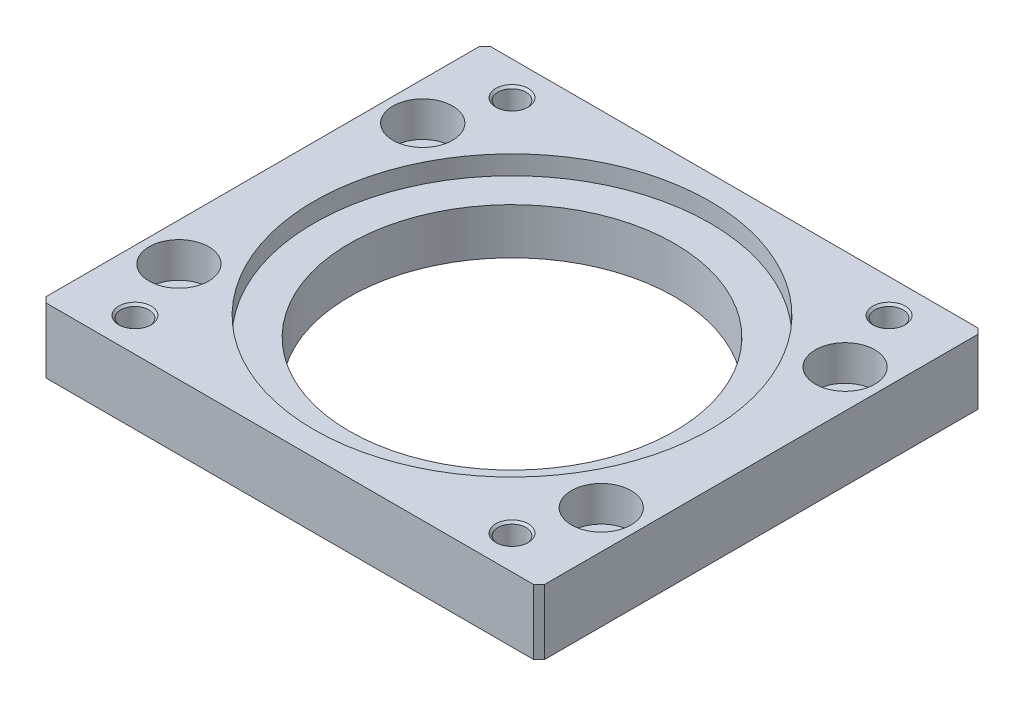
ISO-10303-21;
HEADER;
FILE_DESCRIPTION(('STEP AP214'),'2;1');
FILE_NAME('part.step','',(''),(''),'','','');
FILE_SCHEMA(('AUTOMOTIVE_DESIGN { 1 0 10303 214 1 1 1 1 }'));
ENDSEC;
DATA;
#1=APPLICATION_CONTEXT('core data for automotive mechanical design processes');
#2=APPLICATION_PROTOCOL_DEFINITION('international standard','automotive_design',2000,#1);
#3=PRODUCT_CONTEXT('',#1,'mechanical');
#4=PRODUCT('Part','Part','',(#3));
#5=PRODUCT_RELATED_PRODUCT_CATEGORY('part','',(#4));
#6=PRODUCT_DEFINITION_FORMATION('','',#4);
#7=PRODUCT_DEFINITION_CONTEXT('part definition',#1,'design');
#8=PRODUCT_DEFINITION('design','',#6,#7);
#9=PRODUCT_DEFINITION_SHAPE('','',#8);
#10=(LENGTH_UNIT() NAMED_UNIT(*) SI_UNIT(.MILLI.,.METRE.));
#11=(NAMED_UNIT(*) PLANE_ANGLE_UNIT() SI_UNIT($,.RADIAN.));
#12=(NAMED_UNIT(*) SI_UNIT($,.STERADIAN.) SOLID_ANGLE_UNIT());
#13=UNCERTAINTY_MEASURE_WITH_UNIT(LENGTH_MEASURE(1.E-05),#10,'distance_accuracy_value','');
#14=(GEOMETRIC_REPRESENTATION_CONTEXT(3) GLOBAL_UNCERTAINTY_ASSIGNED_CONTEXT((#13)) GLOBAL_UNIT_ASSIGNED_CONTEXT((#10,
#11,#12)) REPRESENTATION_CONTEXT('',''));
#15=CARTESIAN_POINT('',(0.,0.,0.));
#16=DIRECTION('',(0.,0.,1.));
#17=DIRECTION('',(1.,0.,0.));
#18=AXIS2_PLACEMENT_3D('',#15,#16,#17);
#19=CARTESIAN_POINT('',(-34.79,11.6,34.79));
#20=DIRECTION('',(0.,1.,0.));
#21=DIRECTION('',(-1.,0.,0.));
#22=AXIS2_PLACEMENT_3D('',#19,#20,#21);
#23=CONICAL_SURFACE('',#22,2.6,0.785398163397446);
#24=CARTESIAN_POINT('',(-34.79,11.6,34.79));
#25=DIRECTION('',(0.,1.,0.));
#26=DIRECTION('',(1.,0.,0.));
#27=AXIS2_PLACEMENT_3D('',#24,#25,#26);
#28=CIRCLE('',#27,2.6);
#29=CARTESIAN_POINT('',(-32.19,11.6,34.79));
#30=VERTEX_POINT('',#29);
#31=EDGE_CURVE('E169',#30,#30,#28,.F.);
#32=ORIENTED_EDGE('',*,*,#31,.T.);
#33=EDGE_LOOP('',(#32));
#34=FACE_BOUND('',#33,.T.);
#35=CARTESIAN_POINT('',(-34.79,12.,34.79));
#36=DIRECTION('',(0.,1.,0.));
#37=DIRECTION('',(0.,0.,1.));
#38=AXIS2_PLACEMENT_3D('',#35,#36,#37);
#39=CIRCLE('',#38,3.);
#40=CARTESIAN_POINT('',(-34.79,12.,37.79));
#41=VERTEX_POINT('',#40);
#42=EDGE_CURVE('E188',#41,#41,#39,.T.);
#43=ORIENTED_EDGE('',*,*,#42,.T.);
#44=EDGE_LOOP('',(#43));
#45=FACE_BOUND('',#44,.T.);
#46=ADVANCED_FACE('F16',(#34,#45),#23,.F.);
#47=CARTESIAN_POINT('',(34.79,11.6,34.79));
#48=DIRECTION('',(0.,1.,0.));
#49=DIRECTION('',(0.,0.,1.));
#50=AXIS2_PLACEMENT_3D('',#47,#48,#49);
#51=CONICAL_SURFACE('',#50,2.6,0.785398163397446);
#52=CARTESIAN_POINT('',(34.79,11.6,34.79));
#53=DIRECTION('',(0.,1.,0.));
#54=DIRECTION('',(1.,0.,0.));
#55=AXIS2_PLACEMENT_3D('',#52,#53,#54);
#56=CIRCLE('',#55,2.6);
#57=CARTESIAN_POINT('',(37.39,11.6,34.79));
#58=VERTEX_POINT('',#57);
#59=EDGE_CURVE('E241',#58,#58,#56,.F.);
#60=ORIENTED_EDGE('',*,*,#59,.T.);
#61=EDGE_LOOP('',(#60));
#62=FACE_BOUND('',#61,.T.);
#63=CARTESIAN_POINT('',(34.79,12.,34.79));
#64=DIRECTION('',(0.,1.,0.));
#65=DIRECTION('',(-1.,0.,0.));
#66=AXIS2_PLACEMENT_3D('',#63,#64,#65);
#67=CIRCLE('',#66,2.99999999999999);
#68=CARTESIAN_POINT('',(31.79,12.,34.79));
#69=VERTEX_POINT('',#68);
#70=EDGE_CURVE('E185',#69,#69,#67,.T.);
#71=ORIENTED_EDGE('',*,*,#70,.T.);
#72=EDGE_LOOP('',(#71));
#73=FACE_BOUND('',#72,.T.);
#74=ADVANCED_FACE('F342',(#62,#73),#51,.F.);
#75=CARTESIAN_POINT('',(34.79,11.6,-34.79));
#76=DIRECTION('',(0.,1.,0.));
#77=DIRECTION('',(0.,0.,1.));
#78=AXIS2_PLACEMENT_3D('',#75,#76,#77);
#79=CONICAL_SURFACE('',#78,2.6,0.785398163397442);
#80=CARTESIAN_POINT('',(34.79,11.6,-34.79));
#81=DIRECTION('',(0.,1.,0.));
#82=DIRECTION('',(1.,0.,0.));
#83=AXIS2_PLACEMENT_3D('',#80,#81,#82);
#84=CIRCLE('',#83,2.6);
#85=CARTESIAN_POINT('',(37.39,11.6,-34.79));
#86=VERTEX_POINT('',#85);
#87=EDGE_CURVE('E238',#86,#86,#84,.F.);
#88=ORIENTED_EDGE('',*,*,#87,.T.);
#89=EDGE_LOOP('',(#88));
#90=FACE_BOUND('',#89,.T.);
#91=CARTESIAN_POINT('',(34.79,12.,-34.79));
#92=DIRECTION('',(0.,1.,0.));
#93=DIRECTION('',(0.,0.,1.));
#94=AXIS2_PLACEMENT_3D('',#91,#92,#93);
#95=CIRCLE('',#94,3.);
#96=CARTESIAN_POINT('',(34.79,12.,-31.79));
#97=VERTEX_POINT('',#96);
#98=EDGE_CURVE('E191',#97,#97,#95,.T.);
#99=ORIENTED_EDGE('',*,*,#98,.T.);
#100=EDGE_LOOP('',(#99));
#101=FACE_BOUND('',#100,.T.);
#102=ADVANCED_FACE('F346',(#90,#101),#79,.F.);
#103=CARTESIAN_POINT('',(-34.79,11.6,-34.79));
#104=DIRECTION('',(0.,1.,0.));
#105=DIRECTION('',(0.,0.,1.));
#106=AXIS2_PLACEMENT_3D('',#103,#104,#105);
#107=CONICAL_SURFACE('',#106,2.6,0.78539816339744);
#108=CARTESIAN_POINT('',(-34.79,11.6,-34.79));
#109=DIRECTION('',(0.,1.,0.));
#110=DIRECTION('',(1.,0.,0.));
#111=AXIS2_PLACEMENT_3D('',#108,#109,#110);
#112=CIRCLE('',#111,2.6);
#113=CARTESIAN_POINT('',(-32.19,11.6,-34.79));
#114=VERTEX_POINT('',#113);
#115=EDGE_CURVE('E165',#114,#114,#112,.F.);
#116=ORIENTED_EDGE('',*,*,#115,.T.);
#117=EDGE_LOOP('',(#116));
#118=FACE_BOUND('',#117,.T.);
#119=CARTESIAN_POINT('',(-34.79,12.,-34.79));
#120=DIRECTION('',(0.,1.,0.));
#121=DIRECTION('',(0.,0.,1.));
#122=AXIS2_PLACEMENT_3D('',#119,#120,#121);
#123=CIRCLE('',#122,3.);
#124=CARTESIAN_POINT('',(-34.79,12.,-31.79));
#125=VERTEX_POINT('',#124);
#126=EDGE_CURVE('E170',#125,#125,#123,.T.);
#127=ORIENTED_EDGE('',*,*,#126,.T.);
#128=EDGE_LOOP('',(#127));
#129=FACE_BOUND('',#128,.T.);
#130=ADVANCED_FACE('F350',(#118,#129),#107,.F.);
#131=CARTESIAN_POINT('',(38.9711431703,5.5,-22.5));
#132=DIRECTION('',(0.,1.,0.));
#133=DIRECTION('',(0.,0.,1.));
#134=AXIS2_PLACEMENT_3D('',#131,#132,#133);
#135=CYLINDRICAL_SURFACE('',#134,5.49999999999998);
#136=CARTESIAN_POINT('',(38.9711431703,5.5,-22.5));
#137=DIRECTION('',(0.,1.,0.));
#138=DIRECTION('',(0.,0.,1.));
#139=AXIS2_PLACEMENT_3D('',#136,#137,#138);
#140=CIRCLE('',#139,5.49999999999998);
#141=CARTESIAN_POINT('',(38.9711431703,5.5,-17.));
#142=VERTEX_POINT('',#141);
#143=EDGE_CURVE('E162',#142,#142,#140,.F.);
#144=ORIENTED_EDGE('',*,*,#143,.T.);
#145=EDGE_LOOP('',(#144));
#146=FACE_BOUND('',#145,.T.);
#147=CARTESIAN_POINT('',(38.9711431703,12.,-22.5));
#148=DIRECTION('',(0.,1.,0.));
#149=DIRECTION('',(0.,0.,1.));
#150=AXIS2_PLACEMENT_3D('',#147,#148,#149);
#151=CIRCLE('',#150,5.49999999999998);
#152=CARTESIAN_POINT('',(38.9711431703,12.,-17.));
#153=VERTEX_POINT('',#152);
#154=EDGE_CURVE('E182',#153,#153,#151,.T.);
#155=ORIENTED_EDGE('',*,*,#154,.T.);
#156=EDGE_LOOP('',(#155));
#157=FACE_BOUND('',#156,.T.);
#158=ADVANCED_FACE('F354',(#146,#157),#135,.F.);
#159=CARTESIAN_POINT('',(38.9711431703,5.5,22.5));
#160=DIRECTION('',(0.,1.,0.));
#161=DIRECTION('',(0.,0.,1.));
#162=AXIS2_PLACEMENT_3D('',#159,#160,#161);
#163=CYLINDRICAL_SURFACE('',#162,5.49999999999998);
#164=CARTESIAN_POINT('',(38.9711431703,5.5,22.5));
#165=DIRECTION('',(0.,1.,0.));
#166=DIRECTION('',(0.,0.,1.));
#167=AXIS2_PLACEMENT_3D('',#164,#165,#166);
#168=CIRCLE('',#167,5.49999999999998);
#169=CARTESIAN_POINT('',(38.9711431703,5.5,28.));
#170=VERTEX_POINT('',#169);
#171=EDGE_CURVE('E159',#170,#170,#168,.F.);
#172=ORIENTED_EDGE('',*,*,#171,.T.);
#173=EDGE_LOOP('',(#172));
#174=FACE_BOUND('',#173,.T.);
#175=CARTESIAN_POINT('',(38.9711431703,12.,22.5));
#176=DIRECTION('',(0.,1.,0.));
#177=DIRECTION('',(0.,0.,1.));
#178=AXIS2_PLACEMENT_3D('',#175,#176,#177);
#179=CIRCLE('',#178,5.49999999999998);
#180=CARTESIAN_POINT('',(38.9711431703,12.,28.));
#181=VERTEX_POINT('',#180);
#182=EDGE_CURVE('E173',#181,#181,#179,.T.);
#183=ORIENTED_EDGE('',*,*,#182,.T.);
#184=EDGE_LOOP('',(#183));
#185=FACE_BOUND('',#184,.T.);
#186=ADVANCED_FACE('F358',(#174,#185),#163,.F.);
#187=CARTESIAN_POINT('',(-38.9711431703,5.5,-22.5));
#188=DIRECTION('',(0.,1.,0.));
#189=DIRECTION('',(0.,0.,1.));
#190=AXIS2_PLACEMENT_3D('',#187,#188,#189);
#191=CYLINDRICAL_SURFACE('',#190,5.49999999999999);
#192=CARTESIAN_POINT('',(-38.9711431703,5.5,-22.5));
#193=DIRECTION('',(0.,1.,0.));
#194=DIRECTION('',(0.,0.,1.));
#195=AXIS2_PLACEMENT_3D('',#192,#193,#194);
#196=CIRCLE('',#195,5.49999999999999);
#197=CARTESIAN_POINT('',(-38.9711431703,5.5,-17.));
#198=VERTEX_POINT('',#197);
#199=EDGE_CURVE('E156',#198,#198,#196,.F.);
#200=ORIENTED_EDGE('',*,*,#199,.T.);
#201=EDGE_LOOP('',(#200));
#202=FACE_BOUND('',#201,.T.);
#203=CARTESIAN_POINT('',(-38.9711431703,12.,-22.5));
#204=DIRECTION('',(0.,1.,0.));
#205=DIRECTION('',(0.,0.,1.));
#206=AXIS2_PLACEMENT_3D('',#203,#204,#205);
#207=CIRCLE('',#206,5.49999999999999);
#208=CARTESIAN_POINT('',(-38.9711431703,12.,-17.));
#209=VERTEX_POINT('',#208);
#210=EDGE_CURVE('E179',#209,#209,#207,.T.);
#211=ORIENTED_EDGE('',*,*,#210,.T.);
#212=EDGE_LOOP('',(#211));
#213=FACE_BOUND('',#212,.T.);
#214=ADVANCED_FACE('F362',(#202,#213),#191,.F.);
#215=CARTESIAN_POINT('',(-38.9711431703,5.5,22.5));
#216=DIRECTION('',(0.,1.,0.));
#217=DIRECTION('',(0.,0.,1.));
#218=AXIS2_PLACEMENT_3D('',#215,#216,#217);
#219=CYLINDRICAL_SURFACE('',#218,5.49999999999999);
#220=CARTESIAN_POINT('',(-38.9711431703,5.5,22.5));
#221=DIRECTION('',(0.,1.,0.));
#222=DIRECTION('',(0.,0.,1.));
#223=AXIS2_PLACEMENT_3D('',#220,#221,#222);
#224=CIRCLE('',#223,5.49999999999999);
#225=CARTESIAN_POINT('',(-38.9711431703,5.5,28.));
#226=VERTEX_POINT('',#225);
#227=EDGE_CURVE('E104',#226,#226,#224,.F.);
#228=ORIENTED_EDGE('',*,*,#227,.T.);
#229=EDGE_LOOP('',(#228));
#230=FACE_BOUND('',#229,.T.);
#231=CARTESIAN_POINT('',(-38.9711431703,12.,22.5));
#232=DIRECTION('',(0.,1.,0.));
#233=DIRECTION('',(0.,0.,1.));
#234=AXIS2_PLACEMENT_3D('',#231,#232,#233);
#235=CIRCLE('',#234,5.49999999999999);
#236=CARTESIAN_POINT('',(-38.9711431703,12.,28.));
#237=VERTEX_POINT('',#236);
#238=EDGE_CURVE('E176',#237,#237,#235,.T.);
#239=ORIENTED_EDGE('',*,*,#238,.T.);
#240=EDGE_LOOP('',(#239));
#241=FACE_BOUND('',#240,.T.);
#242=ADVANCED_FACE('F366',(#230,#241),#219,.F.);
#243=CARTESIAN_POINT('',(0.,8.5,0.));
#244=DIRECTION('',(0.,1.,0.));
#245=DIRECTION('',(0.,0.,1.));
#246=AXIS2_PLACEMENT_3D('',#243,#244,#245);
#247=CYLINDRICAL_SURFACE('',#246,36.53);
#248=CARTESIAN_POINT('',(0.,8.5,0.));
#249=DIRECTION('',(0.,1.,0.));
#250=DIRECTION('',(0.,0.,1.));
#251=AXIS2_PLACEMENT_3D('',#248,#249,#250);
#252=CIRCLE('',#251,36.53);
#253=CARTESIAN_POINT('',(0.,8.5,36.53));
#254=VERTEX_POINT('',#253);
#255=EDGE_CURVE('E101',#254,#254,#252,.F.);
#256=ORIENTED_EDGE('',*,*,#255,.T.);
#257=EDGE_LOOP('',(#256));
#258=FACE_BOUND('',#257,.T.);
#259=CARTESIAN_POINT('',(0.,12.,0.));
#260=DIRECTION('',(0.,1.,0.));
#261=DIRECTION('',(0.,0.,1.));
#262=AXIS2_PLACEMENT_3D('',#259,#260,#261);
#263=CIRCLE('',#262,36.53);
#264=CARTESIAN_POINT('',(0.,12.,36.53));
#265=VERTEX_POINT('',#264);
#266=EDGE_CURVE('E166',#265,#265,#263,.T.);
#267=ORIENTED_EDGE('',*,*,#266,.T.);
#268=EDGE_LOOP('',(#267));
#269=FACE_BOUND('',#268,.T.);
#270=ADVANCED_FACE('F339',(#258,#269),#247,.F.);
#271=CARTESIAN_POINT('',(-46.11502949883,12.24,-39.88497050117));
#272=DIRECTION('',(-0.707106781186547,0.,-0.707106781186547));
#273=DIRECTION('',(0.707106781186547,0.,-0.707106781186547));
#274=AXIS2_PLACEMENT_3D('',#271,#272,#273);
#275=PLANE('',#274);
#276=DIRECTION('',(0.707106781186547,0.,-0.707106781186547));
#277=VECTOR('',#276,1.);
#278=CARTESIAN_POINT('',(-46.11502949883,12.,-39.88497050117));
#279=LINE('',#278,#277);
#280=CARTESIAN_POINT('',(-46.,12.,-40.));
#281=VERTEX_POINT('',#280);
#282=CARTESIAN_POINT('',(-45.,12.,-41.));
#283=VERTEX_POINT('',#282);
#284=EDGE_CURVE('E194',#281,#283,#279,.T.);
#285=ORIENTED_EDGE('',*,*,#284,.T.);
#286=DIRECTION('',(0.,1.,0.));
#287=VECTOR('',#286,1.);
#288=CARTESIAN_POINT('',(-45.,6.,-41.));
#289=LINE('',#288,#287);
#290=CARTESIAN_POINT('',(-45.,0.,-41.));
#291=VERTEX_POINT('',#290);
#292=EDGE_CURVE('E97',#283,#291,#289,.F.);
#293=ORIENTED_EDGE('',*,*,#292,.T.);
#294=DIRECTION('',(-0.707106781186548,0.,0.707106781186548));
#295=VECTOR('',#294,1.);
#296=CARTESIAN_POINT('',(-45.5,0.,-40.5));
#297=LINE('',#296,#295);
#298=CARTESIAN_POINT('',(-46.,0.,-40.));
#299=VERTEX_POINT('',#298);
#300=EDGE_CURVE('E234',#299,#291,#297,.F.);
#301=ORIENTED_EDGE('',*,*,#300,.F.);
#302=DIRECTION('',(0.,-1.,0.));
#303=VECTOR('',#302,1.);
#304=CARTESIAN_POINT('',(-46.,6.,-40.));
#305=LINE('',#304,#303);
#306=EDGE_CURVE('E247',#299,#281,#305,.F.);
#307=ORIENTED_EDGE('',*,*,#306,.T.);
#308=EDGE_LOOP('',(#285,#293,#301,#307));
#309=FACE_BOUND('',#308,.T.);
#310=ADVANCED_FACE('F250',(#309),#275,.T.);
#311=CARTESIAN_POINT('',(-44.88497050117,12.24,41.11502949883));
#312=DIRECTION('',(-0.707106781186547,0.,0.707106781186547));
#313=DIRECTION('',(-0.707106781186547,0.,-0.707106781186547));
#314=AXIS2_PLACEMENT_3D('',#311,#312,#313);
#315=PLANE('',#314);
#316=DIRECTION('',(-0.707106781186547,0.,-0.707106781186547));
#317=VECTOR('',#316,1.);
#318=CARTESIAN_POINT('',(-44.88497050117,12.,41.11502949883));
#319=LINE('',#318,#317);
#320=CARTESIAN_POINT('',(-45.,12.,41.));
#321=VERTEX_POINT('',#320);
#322=CARTESIAN_POINT('',(-46.,12.,40.));
#323=VERTEX_POINT('',#322);
#324=EDGE_CURVE('E196',#321,#323,#319,.T.);
#325=ORIENTED_EDGE('',*,*,#324,.T.);
#326=DIRECTION('',(0.,1.,0.));
#327=VECTOR('',#326,1.);
#328=CARTESIAN_POINT('',(-46.,6.,40.));
#329=LINE('',#328,#327);
#330=CARTESIAN_POINT('',(-46.,0.,40.));
#331=VERTEX_POINT('',#330);
#332=EDGE_CURVE('E212',#323,#331,#329,.F.);
#333=ORIENTED_EDGE('',*,*,#332,.T.);
#334=DIRECTION('',(0.707106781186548,0.,0.707106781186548));
#335=VECTOR('',#334,1.);
#336=CARTESIAN_POINT('',(-45.5,0.,40.5));
#337=LINE('',#336,#335);
#338=CARTESIAN_POINT('',(-45.,0.,41.));
#339=VERTEX_POINT('',#338);
#340=EDGE_CURVE('E232',#339,#331,#337,.F.);
#341=ORIENTED_EDGE('',*,*,#340,.F.);
#342=DIRECTION('',(0.,-1.,0.));
#343=VECTOR('',#342,1.);
#344=CARTESIAN_POINT('',(-45.,6.,41.));
#345=LINE('',#344,#343);
#346=EDGE_CURVE('E210',#339,#321,#345,.F.);
#347=ORIENTED_EDGE('',*,*,#346,.T.);
#348=EDGE_LOOP('',(#325,#333,#341,#347));
#349=FACE_BOUND('',#348,.T.);
#350=ADVANCED_FACE('F333',(#349),#315,.T.);
#351=CARTESIAN_POINT('',(44.88497050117,12.24,-41.11502949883));
#352=DIRECTION('',(0.707106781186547,0.,-0.707106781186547));
#353=DIRECTION('',(0.707106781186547,0.,0.707106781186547));
#354=AXIS2_PLACEMENT_3D('',#351,#352,#353);
#355=PLANE('',#354);
#356=DIRECTION('',(0.707106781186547,0.,0.707106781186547));
#357=VECTOR('',#356,1.);
#358=CARTESIAN_POINT('',(44.88497050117,12.,-41.11502949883));
#359=LINE('',#358,#357);
#360=CARTESIAN_POINT('',(45.,12.,-41.));
#361=VERTEX_POINT('',#360);
#362=CARTESIAN_POINT('',(46.,12.,-40.));
#363=VERTEX_POINT('',#362);
#364=EDGE_CURVE('E20',#361,#363,#359,.T.);
#365=ORIENTED_EDGE('',*,*,#364,.T.);
#366=DIRECTION('',(0.,1.,0.));
#367=VECTOR('',#366,1.);
#368=CARTESIAN_POINT('',(46.,6.,-40.));
#369=LINE('',#368,#367);
#370=CARTESIAN_POINT('',(46.,0.,-40.));
#371=VERTEX_POINT('',#370);
#372=EDGE_CURVE('E110',#363,#371,#369,.F.);
#373=ORIENTED_EDGE('',*,*,#372,.T.);
#374=DIRECTION('',(-0.707106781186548,0.,-0.707106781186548));
#375=VECTOR('',#374,1.);
#376=CARTESIAN_POINT('',(45.5,0.,-40.5));
#377=LINE('',#376,#375);
#378=CARTESIAN_POINT('',(45.,0.,-41.));
#379=VERTEX_POINT('',#378);
#380=EDGE_CURVE('E100',#379,#371,#377,.F.);
#381=ORIENTED_EDGE('',*,*,#380,.F.);
#382=DIRECTION('',(0.,-1.,0.));
#383=VECTOR('',#382,1.);
#384=CARTESIAN_POINT('',(45.,6.,-41.));
#385=LINE('',#384,#383);
#386=EDGE_CURVE('E94',#379,#361,#385,.F.);
#387=ORIENTED_EDGE('',*,*,#386,.T.);
#388=EDGE_LOOP('',(#365,#373,#381,#387));
#389=FACE_BOUND('',#388,.T.);
#390=ADVANCED_FACE('F99',(#389),#355,.T.);
#391=CARTESIAN_POINT('',(46.11502949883,12.24,39.88497050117));
#392=DIRECTION('',(0.707106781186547,0.,0.707106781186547));
#393=DIRECTION('',(-0.707106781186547,0.,0.707106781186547));
#394=AXIS2_PLACEMENT_3D('',#391,#392,#393);
#395=PLANE('',#394);
#396=DIRECTION('',(-0.707106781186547,0.,0.707106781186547));
#397=VECTOR('',#396,1.);
#398=CARTESIAN_POINT('',(46.11502949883,12.,39.88497050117));
#399=LINE('',#398,#397);
#400=CARTESIAN_POINT('',(46.,12.,40.));
#401=VERTEX_POINT('',#400);
#402=CARTESIAN_POINT('',(45.,12.,41.));
#403=VERTEX_POINT('',#402);
#404=EDGE_CURVE('E88',#401,#403,#399,.T.);
#405=ORIENTED_EDGE('',*,*,#404,.T.);
#406=DIRECTION('',(0.,1.,0.));
#407=VECTOR('',#406,1.);
#408=CARTESIAN_POINT('',(45.,6.,41.));
#409=LINE('',#408,#407);
#410=CARTESIAN_POINT('',(45.,0.,41.));
#411=VERTEX_POINT('',#410);
#412=EDGE_CURVE('E108',#403,#411,#409,.F.);
#413=ORIENTED_EDGE('',*,*,#412,.T.);
#414=DIRECTION('',(0.707106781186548,0.,-0.707106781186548));
#415=VECTOR('',#414,1.);
#416=CARTESIAN_POINT('',(45.5,0.,40.5));
#417=LINE('',#416,#415);
#418=CARTESIAN_POINT('',(46.,0.,40.));
#419=VERTEX_POINT('',#418);
#420=EDGE_CURVE('E35',#419,#411,#417,.F.);
#421=ORIENTED_EDGE('',*,*,#420,.F.);
#422=DIRECTION('',(0.,-1.,0.));
#423=VECTOR('',#422,1.);
#424=CARTESIAN_POINT('',(46.,6.,40.));
#425=LINE('',#424,#423);
#426=EDGE_CURVE('E111',#419,#401,#425,.F.);
#427=ORIENTED_EDGE('',*,*,#426,.T.);
#428=EDGE_LOOP('',(#405,#413,#421,#427));
#429=FACE_BOUND('',#428,.T.);
#430=ADVANCED_FACE('F198',(#429),#395,.T.);
#431=CARTESIAN_POINT('',(-47.84,12.,42.64));
#432=DIRECTION('',(0.,1.,0.));
#433=DIRECTION('',(1.,0.,0.));
#434=AXIS2_PLACEMENT_3D('',#431,#432,#433);
#435=PLANE('',#434);
#436=ORIENTED_EDGE('',*,*,#266,.F.);
#437=EDGE_LOOP('',(#436));
#438=FACE_BOUND('',#437,.T.);
#439=ORIENTED_EDGE('',*,*,#126,.F.);
#440=EDGE_LOOP('',(#439));
#441=FACE_BOUND('',#440,.T.);
#442=ORIENTED_EDGE('',*,*,#182,.F.);
#443=EDGE_LOOP('',(#442));
#444=FACE_BOUND('',#443,.T.);
#445=ORIENTED_EDGE('',*,*,#238,.F.);
#446=EDGE_LOOP('',(#445));
#447=FACE_BOUND('',#446,.T.);
#448=ORIENTED_EDGE('',*,*,#210,.F.);
#449=EDGE_LOOP('',(#448));
#450=FACE_BOUND('',#449,.T.);
#451=ORIENTED_EDGE('',*,*,#154,.F.);
#452=EDGE_LOOP('',(#451));
#453=FACE_BOUND('',#452,.T.);
#454=ORIENTED_EDGE('',*,*,#70,.F.);
#455=EDGE_LOOP('',(#454));
#456=FACE_BOUND('',#455,.T.);
#457=ORIENTED_EDGE('',*,*,#42,.F.);
#458=EDGE_LOOP('',(#457));
#459=FACE_BOUND('',#458,.T.);
#460=ORIENTED_EDGE('',*,*,#98,.F.);
#461=EDGE_LOOP('',(#460));
#462=FACE_BOUND('',#461,.T.);
#463=ORIENTED_EDGE('',*,*,#284,.F.);
#464=DIRECTION('',(0.,0.,-1.));
#465=VECTOR('',#464,1.);
#466=CARTESIAN_POINT('',(-46.,12.,0.));
#467=LINE('',#466,#465);
#468=EDGE_CURVE('E218',#281,#323,#467,.F.);
#469=ORIENTED_EDGE('',*,*,#468,.T.);
#470=ORIENTED_EDGE('',*,*,#324,.F.);
#471=DIRECTION('',(-1.,0.,0.));
#472=VECTOR('',#471,1.);
#473=CARTESIAN_POINT('',(0.,12.,41.));
#474=LINE('',#473,#472);
#475=EDGE_CURVE('E205',#321,#403,#474,.F.);
#476=ORIENTED_EDGE('',*,*,#475,.T.);
#477=ORIENTED_EDGE('',*,*,#404,.F.);
#478=DIRECTION('',(0.,0.,1.));
#479=VECTOR('',#478,1.);
#480=CARTESIAN_POINT('',(46.,12.,0.));
#481=LINE('',#480,#479);
#482=EDGE_CURVE('E84',#401,#363,#481,.F.);
#483=ORIENTED_EDGE('',*,*,#482,.T.);
#484=ORIENTED_EDGE('',*,*,#364,.F.);
#485=DIRECTION('',(1.,0.,0.));
#486=VECTOR('',#485,1.);
#487=CARTESIAN_POINT('',(0.,12.,-41.));
#488=LINE('',#487,#486);
#489=EDGE_CURVE('E82',#361,#283,#488,.F.);
#490=ORIENTED_EDGE('',*,*,#489,.T.);
#491=EDGE_LOOP('',(#463,#469,#470,#476,#477,#483,#484,#490));
#492=FACE_BOUND('',#491,.T.);
#493=ADVANCED_FACE('F81',(#438,#441,#444,#447,#450,#453,#456,#459,#462,#492),#435,.T.);
#494=CARTESIAN_POINT('',(-34.79,0.399999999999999,34.79));
#495=DIRECTION('',(0.,1.,0.));
#496=DIRECTION('',(0.,0.,1.));
#497=AXIS2_PLACEMENT_3D('',#494,#495,#496);
#498=CYLINDRICAL_SURFACE('',#497,2.6);
#499=CARTESIAN_POINT('',(-34.79,0.399999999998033,34.79));
#500=DIRECTION('',(0.,-1.,0.));
#501=DIRECTION('',(0.,0.,-1.));
#502=AXIS2_PLACEMENT_3D('',#499,#500,#501);
#503=CIRCLE('',#502,2.59999999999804);
#504=CARTESIAN_POINT('',(-34.79,0.399999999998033,32.190000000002));
#505=VERTEX_POINT('',#504);
#506=EDGE_CURVE('E219',#505,#505,#503,.T.);
#507=ORIENTED_EDGE('',*,*,#506,.T.);
#508=EDGE_LOOP('',(#507));
#509=FACE_BOUND('',#508,.T.);
#510=ORIENTED_EDGE('',*,*,#31,.F.);
#511=EDGE_LOOP('',(#510));
#512=FACE_BOUND('',#511,.T.);
#513=ADVANCED_FACE('F327',(#509,#512),#498,.F.);
#514=CARTESIAN_POINT('',(34.79,0.399999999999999,34.79));
#515=DIRECTION('',(0.,1.,0.));
#516=DIRECTION('',(0.,0.,1.));
#517=AXIS2_PLACEMENT_3D('',#514,#515,#516);
#518=CYLINDRICAL_SURFACE('',#517,2.6);
#519=CARTESIAN_POINT('',(34.79,0.399999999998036,34.79));
#520=DIRECTION('',(0.,-1.,0.));
#521=DIRECTION('',(0.,0.,-1.));
#522=AXIS2_PLACEMENT_3D('',#519,#520,#521);
#523=CIRCLE('',#522,2.59999999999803);
#524=CARTESIAN_POINT('',(34.79,0.399999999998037,32.190000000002));
#525=VERTEX_POINT('',#524);
#526=EDGE_CURVE('E221',#525,#525,#523,.T.);
#527=ORIENTED_EDGE('',*,*,#526,.T.);
#528=EDGE_LOOP('',(#527));
#529=FACE_BOUND('',#528,.T.);
#530=ORIENTED_EDGE('',*,*,#59,.F.);
#531=EDGE_LOOP('',(#530));
#532=FACE_BOUND('',#531,.T.);
#533=ADVANCED_FACE('F376',(#529,#532),#518,.F.);
#534=CARTESIAN_POINT('',(34.79,0.399999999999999,-34.79));
#535=DIRECTION('',(0.,1.,0.));
#536=DIRECTION('',(0.,0.,1.));
#537=AXIS2_PLACEMENT_3D('',#534,#535,#536);
#538=CYLINDRICAL_SURFACE('',#537,2.6);
#539=CARTESIAN_POINT('',(34.79,0.399999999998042,-34.79));
#540=DIRECTION('',(0.,-1.,0.));
#541=DIRECTION('',(0.,0.,-1.));
#542=AXIS2_PLACEMENT_3D('',#539,#540,#541);
#543=CIRCLE('',#542,2.59999999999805);
#544=CARTESIAN_POINT('',(34.79,0.399999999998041,-37.389999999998));
#545=VERTEX_POINT('',#544);
#546=EDGE_CURVE('E226',#545,#545,#543,.T.);
#547=ORIENTED_EDGE('',*,*,#546,.T.);
#548=EDGE_LOOP('',(#547));
#549=FACE_BOUND('',#548,.T.);
#550=ORIENTED_EDGE('',*,*,#87,.F.);
#551=EDGE_LOOP('',(#550));
#552=FACE_BOUND('',#551,.T.);
#553=ADVANCED_FACE('F263',(#549,#552),#538,.F.);
#554=CARTESIAN_POINT('',(-34.79,0.399999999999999,-34.79));
#555=DIRECTION('',(0.,1.,0.));
#556=DIRECTION('',(0.,0.,1.));
#557=AXIS2_PLACEMENT_3D('',#554,#555,#556);
#558=CYLINDRICAL_SURFACE('',#557,2.6);
#559=CARTESIAN_POINT('',(-34.79,0.399999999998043,-34.79));
#560=DIRECTION('',(0.,-1.,0.));
#561=DIRECTION('',(0.,0.,-1.));
#562=AXIS2_PLACEMENT_3D('',#559,#560,#561);
#563=CIRCLE('',#562,2.59999999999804);
#564=CARTESIAN_POINT('',(-34.79,0.399999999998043,-37.389999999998));
#565=VERTEX_POINT('',#564);
#566=EDGE_CURVE('E152',#565,#565,#563,.T.);
#567=ORIENTED_EDGE('',*,*,#566,.T.);
#568=EDGE_LOOP('',(#567));
#569=FACE_BOUND('',#568,.T.);
#570=ORIENTED_EDGE('',*,*,#115,.F.);
#571=EDGE_LOOP('',(#570));
#572=FACE_BOUND('',#571,.T.);
#573=ADVANCED_FACE('F323',(#569,#572),#558,.F.);
#574=CARTESIAN_POINT('',(-46.24998889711,5.5,29.13192006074));
#575=DIRECTION('',(0.,1.,0.));
#576=DIRECTION('',(1.,0.,0.));
#577=AXIS2_PLACEMENT_3D('',#574,#575,#576);
#578=PLANE('',#577);
#579=CARTESIAN_POINT('',(38.9711431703,5.5,-22.5));
#580=DIRECTION('',(0.,1.,0.));
#581=DIRECTION('',(0.,0.,1.));
#582=AXIS2_PLACEMENT_3D('',#579,#580,#581);
#583=CIRCLE('',#582,3.24999999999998);
#584=CARTESIAN_POINT('',(38.9711431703,5.5,-19.25));
#585=VERTEX_POINT('',#584);
#586=EDGE_CURVE('E150',#585,#585,#583,.F.);
#587=ORIENTED_EDGE('',*,*,#586,.T.);
#588=EDGE_LOOP('',(#587));
#589=FACE_BOUND('',#588,.T.);
#590=ORIENTED_EDGE('',*,*,#143,.F.);
#591=EDGE_LOOP('',(#590));
#592=FACE_BOUND('',#591,.T.);
#593=ADVANCED_FACE('F319',(#589,#592),#578,.T.);
#594=CARTESIAN_POINT('',(-46.24998889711,5.5,29.13192006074));
#595=DIRECTION('',(0.,1.,0.));
#596=DIRECTION('',(1.,0.,0.));
#597=AXIS2_PLACEMENT_3D('',#594,#595,#596);
#598=PLANE('',#597);
#599=CARTESIAN_POINT('',(38.9711431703,5.5,22.5));
#600=DIRECTION('',(0.,1.,0.));
#601=DIRECTION('',(0.,0.,1.));
#602=AXIS2_PLACEMENT_3D('',#599,#600,#601);
#603=CIRCLE('',#602,3.24999999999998);
#604=CARTESIAN_POINT('',(38.9711431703,5.5,25.75));
#605=VERTEX_POINT('',#604);
#606=EDGE_CURVE('E147',#605,#605,#603,.F.);
#607=ORIENTED_EDGE('',*,*,#606,.T.);
#608=EDGE_LOOP('',(#607));
#609=FACE_BOUND('',#608,.T.);
#610=ORIENTED_EDGE('',*,*,#171,.F.);
#611=EDGE_LOOP('',(#610));
#612=FACE_BOUND('',#611,.T.);
#613=ADVANCED_FACE('F315',(#609,#612),#598,.T.);
#614=CARTESIAN_POINT('',(-46.24998889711,5.5,29.13192006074));
#615=DIRECTION('',(0.,1.,0.));
#616=DIRECTION('',(1.,0.,0.));
#617=AXIS2_PLACEMENT_3D('',#614,#615,#616);
#618=PLANE('',#617);
#619=CARTESIAN_POINT('',(-38.9711431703,5.5,-22.5));
#620=DIRECTION('',(0.,1.,0.));
#621=DIRECTION('',(0.,0.,1.));
#622=AXIS2_PLACEMENT_3D('',#619,#620,#621);
#623=CIRCLE('',#622,3.25);
#624=CARTESIAN_POINT('',(-38.9711431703,5.5,-19.25));
#625=VERTEX_POINT('',#624);
#626=EDGE_CURVE('E144',#625,#625,#623,.F.);
#627=ORIENTED_EDGE('',*,*,#626,.T.);
#628=EDGE_LOOP('',(#627));
#629=FACE_BOUND('',#628,.T.);
#630=ORIENTED_EDGE('',*,*,#199,.F.);
#631=EDGE_LOOP('',(#630));
#632=FACE_BOUND('',#631,.T.);
#633=ADVANCED_FACE('F311',(#629,#632),#618,.T.);
#634=CARTESIAN_POINT('',(-46.24998889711,5.5,29.13192006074));
#635=DIRECTION('',(0.,1.,0.));
#636=DIRECTION('',(1.,0.,0.));
#637=AXIS2_PLACEMENT_3D('',#634,#635,#636);
#638=PLANE('',#637);
#639=CARTESIAN_POINT('',(-38.9711431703,5.5,22.5));
#640=DIRECTION('',(0.,1.,0.));
#641=DIRECTION('',(0.,0.,1.));
#642=AXIS2_PLACEMENT_3D('',#639,#640,#641);
#643=CIRCLE('',#642,3.25);
#644=CARTESIAN_POINT('',(-38.9711431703,5.5,25.75));
#645=VERTEX_POINT('',#644);
#646=EDGE_CURVE('E141',#645,#645,#643,.F.);
#647=ORIENTED_EDGE('',*,*,#646,.T.);
#648=EDGE_LOOP('',(#647));
#649=FACE_BOUND('',#648,.T.);
#650=ORIENTED_EDGE('',*,*,#227,.F.);
#651=EDGE_LOOP('',(#650));
#652=FACE_BOUND('',#651,.T.);
#653=ADVANCED_FACE('F307',(#649,#652),#638,.T.);
#654=CARTESIAN_POINT('',(-37.9912,8.5,38.02249063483));
#655=DIRECTION('',(0.,1.,0.));
#656=DIRECTION('',(1.,0.,0.));
#657=AXIS2_PLACEMENT_3D('',#654,#655,#656);
#658=PLANE('',#657);
#659=CARTESIAN_POINT('',(0.,8.5,0.));
#660=DIRECTION('',(0.,1.,0.));
#661=DIRECTION('',(0.,0.,1.));
#662=AXIS2_PLACEMENT_3D('',#659,#660,#661);
#663=CIRCLE('',#662,30.);
#664=CARTESIAN_POINT('',(0.,8.5,30.));
#665=VERTEX_POINT('',#664);
#666=EDGE_CURVE('E137',#665,#665,#663,.F.);
#667=ORIENTED_EDGE('',*,*,#666,.T.);
#668=EDGE_LOOP('',(#667));
#669=FACE_BOUND('',#668,.T.);
#670=ORIENTED_EDGE('',*,*,#255,.F.);
#671=EDGE_LOOP('',(#670));
#672=FACE_BOUND('',#671,.T.);
#673=ADVANCED_FACE('F304',(#669,#672),#658,.T.);
#674=CARTESIAN_POINT('',(46.8,-0.24,-41.));
#675=DIRECTION('',(0.,0.,-1.));
#676=DIRECTION('',(-1.,0.,0.));
#677=AXIS2_PLACEMENT_3D('',#674,#675,#676);
#678=PLANE('',#677);
#679=ORIENTED_EDGE('',*,*,#292,.F.);
#680=ORIENTED_EDGE('',*,*,#489,.F.);
#681=ORIENTED_EDGE('',*,*,#386,.F.);
#682=DIRECTION('',(-1.,0.,0.));
#683=VECTOR('',#682,1.);
#684=CARTESIAN_POINT('',(0.,0.,-41.));
#685=LINE('',#684,#683);
#686=EDGE_CURVE('E140',#379,#291,#685,.T.);
#687=ORIENTED_EDGE('',*,*,#686,.T.);
#688=EDGE_LOOP('',(#679,#680,#681,#687));
#689=FACE_BOUND('',#688,.T.);
#690=ADVANCED_FACE('F92',(#689),#678,.T.);
#691=CARTESIAN_POINT('',(-46.,-0.24,-41.6));
#692=DIRECTION('',(-1.,0.,0.));
#693=DIRECTION('',(0.,0.,1.));
#694=AXIS2_PLACEMENT_3D('',#691,#692,#693);
#695=PLANE('',#694);
#696=ORIENTED_EDGE('',*,*,#332,.F.);
#697=ORIENTED_EDGE('',*,*,#468,.F.);
#698=ORIENTED_EDGE('',*,*,#306,.F.);
#699=DIRECTION('',(0.,0.,1.));
#700=VECTOR('',#699,1.);
#701=CARTESIAN_POINT('',(-46.,0.,0.));
#702=LINE('',#701,#700);
#703=EDGE_CURVE('E253',#299,#331,#702,.T.);
#704=ORIENTED_EDGE('',*,*,#703,.T.);
#705=EDGE_LOOP('',(#696,#697,#698,#704));
#706=FACE_BOUND('',#705,.T.);
#707=ADVANCED_FACE('F296',(#706),#695,.T.);
#708=CARTESIAN_POINT('',(-46.8,-0.24,41.));
#709=DIRECTION('',(0.,0.,1.));
#710=DIRECTION('',(1.,0.,0.));
#711=AXIS2_PLACEMENT_3D('',#708,#709,#710);
#712=PLANE('',#711);
#713=ORIENTED_EDGE('',*,*,#412,.F.);
#714=ORIENTED_EDGE('',*,*,#475,.F.);
#715=ORIENTED_EDGE('',*,*,#346,.F.);
#716=DIRECTION('',(1.,0.,0.));
#717=VECTOR('',#716,1.);
#718=CARTESIAN_POINT('',(0.,0.,41.));
#719=LINE('',#718,#717);
#720=EDGE_CURVE('E208',#339,#411,#719,.T.);
#721=ORIENTED_EDGE('',*,*,#720,.T.);
#722=EDGE_LOOP('',(#713,#714,#715,#721));
#723=FACE_BOUND('',#722,.T.);
#724=ADVANCED_FACE('F203',(#723),#712,.T.);
#725=CARTESIAN_POINT('',(46.,-0.24,41.6));
#726=DIRECTION('',(1.,0.,0.));
#727=DIRECTION('',(0.,0.,-1.));
#728=AXIS2_PLACEMENT_3D('',#725,#726,#727);
#729=PLANE('',#728);
#730=ORIENTED_EDGE('',*,*,#426,.F.);
#731=DIRECTION('',(0.,0.,-1.));
#732=VECTOR('',#731,1.);
#733=CARTESIAN_POINT('',(46.,0.,0.));
#734=LINE('',#733,#732);
#735=EDGE_CURVE('E136',#419,#371,#734,.T.);
#736=ORIENTED_EDGE('',*,*,#735,.T.);
#737=ORIENTED_EDGE('',*,*,#372,.F.);
#738=ORIENTED_EDGE('',*,*,#482,.F.);
#739=EDGE_LOOP('',(#730,#736,#737,#738));
#740=FACE_BOUND('',#739,.T.);
#741=ADVANCED_FACE('F286',(#740),#729,.T.);
#742=CARTESIAN_POINT('',(-34.79,0.39999999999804,34.79));
#743=DIRECTION('',(0.,-1.,0.));
#744=DIRECTION('',(0.,0.,-1.));
#745=AXIS2_PLACEMENT_3D('',#742,#743,#744);
#746=CONICAL_SURFACE('',#745,2.59999999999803,0.78539816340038);
#747=ORIENTED_EDGE('',*,*,#506,.F.);
#748=EDGE_LOOP('',(#747));
#749=FACE_BOUND('',#748,.T.);
#750=CARTESIAN_POINT('',(-34.79,-7.90329173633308E-13,34.79));
#751=DIRECTION('',(0.,-1.,0.));
#752=DIRECTION('',(1.,0.,0.));
#753=AXIS2_PLACEMENT_3D('',#750,#751,#752);
#754=CIRCLE('',#753,2.99999999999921);
#755=CARTESIAN_POINT('',(-31.7900000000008,-7.90360448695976E-13,34.79));
#756=VERTEX_POINT('',#755);
#757=EDGE_CURVE('E133',#756,#756,#754,.T.);
#758=ORIENTED_EDGE('',*,*,#757,.T.);
#759=EDGE_LOOP('',(#758));
#760=FACE_BOUND('',#759,.T.);
#761=ADVANCED_FACE('F288',(#749,#760),#746,.F.);
#762=CARTESIAN_POINT('',(34.79,0.399999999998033,34.79));
#763=DIRECTION('',(0.,-1.,0.));
#764=DIRECTION('',(1.,0.,0.));
#765=AXIS2_PLACEMENT_3D('',#762,#763,#764);
#766=CONICAL_SURFACE('',#765,2.59999999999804,0.785398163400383);
#767=ORIENTED_EDGE('',*,*,#526,.F.);
#768=EDGE_LOOP('',(#767));
#769=FACE_BOUND('',#768,.T.);
#770=CARTESIAN_POINT('',(34.79,-7.92605998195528E-13,34.79));
#771=DIRECTION('',(0.,-1.,0.));
#772=DIRECTION('',(0.,0.,-1.));
#773=AXIS2_PLACEMENT_3D('',#770,#771,#772);
#774=CIRCLE('',#773,2.99999999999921);
#775=CARTESIAN_POINT('',(34.79,-7.92605998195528E-13,31.7900000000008));
#776=VERTEX_POINT('',#775);
#777=EDGE_CURVE('E130',#776,#776,#774,.T.);
#778=ORIENTED_EDGE('',*,*,#777,.T.);
#779=EDGE_LOOP('',(#778));
#780=FACE_BOUND('',#779,.T.);
#781=ADVANCED_FACE('F270',(#769,#780),#766,.F.);
#782=CARTESIAN_POINT('',(34.79,0.399999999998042,-34.79));
#783=DIRECTION('',(0.,-1.,0.));
#784=DIRECTION('',(1.,0.,0.));
#785=AXIS2_PLACEMENT_3D('',#782,#783,#784);
#786=CONICAL_SURFACE('',#785,2.59999999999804,0.785398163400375);
#787=ORIENTED_EDGE('',*,*,#546,.F.);
#788=EDGE_LOOP('',(#787));
#789=FACE_BOUND('',#788,.T.);
#790=CARTESIAN_POINT('',(34.79,-7.95099663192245E-13,-34.79));
#791=DIRECTION('',(0.,-1.,0.));
#792=DIRECTION('',(1.,0.,0.));
#793=AXIS2_PLACEMENT_3D('',#790,#791,#792);
#794=CIRCLE('',#793,2.99999999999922);
#795=CARTESIAN_POINT('',(37.7899999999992,-7.95130938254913E-13,-34.79));
#796=VERTEX_POINT('',#795);
#797=EDGE_CURVE('E127',#796,#796,#794,.T.);
#798=ORIENTED_EDGE('',*,*,#797,.T.);
#799=EDGE_LOOP('',(#798));
#800=FACE_BOUND('',#799,.T.);
#801=ADVANCED_FACE('F266',(#789,#800),#786,.F.);
#802=CARTESIAN_POINT('',(-34.79,0.399999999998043,-34.79));
#803=DIRECTION('',(0.,-1.,0.));
#804=DIRECTION('',(0.,0.,-1.));
#805=AXIS2_PLACEMENT_3D('',#802,#803,#804);
#806=CONICAL_SURFACE('',#805,2.59999999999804,0.785398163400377);
#807=ORIENTED_EDGE('',*,*,#566,.F.);
#808=EDGE_LOOP('',(#807));
#809=FACE_BOUND('',#808,.T.);
#810=CARTESIAN_POINT('',(-34.79,-7.80300303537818E-13,-34.79));
#811=DIRECTION('',(0.,-1.,0.));
#812=DIRECTION('',(0.,0.,-1.));
#813=AXIS2_PLACEMENT_3D('',#810,#811,#812);
#814=CIRCLE('',#813,2.99999999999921);
#815=CARTESIAN_POINT('',(-34.79,-7.80300303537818E-13,-37.7899999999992));
#816=VERTEX_POINT('',#815);
#817=EDGE_CURVE('E124',#816,#816,#814,.T.);
#818=ORIENTED_EDGE('',*,*,#817,.T.);
#819=EDGE_LOOP('',(#818));
#820=FACE_BOUND('',#819,.T.);
#821=ADVANCED_FACE('F269',(#809,#820),#806,.F.);
#822=CARTESIAN_POINT('',(38.9711431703,0.,-22.5));
#823=DIRECTION('',(0.,1.,0.));
#824=DIRECTION('',(0.,0.,1.));
#825=AXIS2_PLACEMENT_3D('',#822,#823,#824);
#826=CYLINDRICAL_SURFACE('',#825,3.24999999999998);
#827=CARTESIAN_POINT('',(38.9711431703,0.,-22.5));
#828=DIRECTION('',(0.,1.,0.));
#829=DIRECTION('',(0.,0.,1.));
#830=AXIS2_PLACEMENT_3D('',#827,#828,#829);
#831=CIRCLE('',#830,3.24999999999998);
#832=CARTESIAN_POINT('',(38.9711431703,0.,-19.25));
#833=VERTEX_POINT('',#832);
#834=EDGE_CURVE('E121',#833,#833,#831,.F.);
#835=ORIENTED_EDGE('',*,*,#834,.T.);
#836=EDGE_LOOP('',(#835));
#837=FACE_BOUND('',#836,.T.);
#838=ORIENTED_EDGE('',*,*,#586,.F.);
#839=EDGE_LOOP('',(#838));
#840=FACE_BOUND('',#839,.T.);
#841=ADVANCED_FACE('F390',(#837,#840),#826,.F.);
#842=CARTESIAN_POINT('',(38.9711431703,0.,22.5));
#843=DIRECTION('',(0.,1.,0.));
#844=DIRECTION('',(0.,0.,1.));
#845=AXIS2_PLACEMENT_3D('',#842,#843,#844);
#846=CYLINDRICAL_SURFACE('',#845,3.24999999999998);
#847=CARTESIAN_POINT('',(38.9711431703,0.,22.5));
#848=DIRECTION('',(0.,1.,0.));
#849=DIRECTION('',(0.,0.,1.));
#850=AXIS2_PLACEMENT_3D('',#847,#848,#849);
#851=CIRCLE('',#850,3.24999999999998);
#852=CARTESIAN_POINT('',(38.9711431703,0.,25.75));
#853=VERTEX_POINT('',#852);
#854=EDGE_CURVE('E118',#853,#853,#851,.F.);
#855=ORIENTED_EDGE('',*,*,#854,.T.);
#856=EDGE_LOOP('',(#855));
#857=FACE_BOUND('',#856,.T.);
#858=ORIENTED_EDGE('',*,*,#606,.F.);
#859=EDGE_LOOP('',(#858));
#860=FACE_BOUND('',#859,.T.);
#861=ADVANCED_FACE('F394',(#857,#860),#846,.F.);
#862=CARTESIAN_POINT('',(-38.9711431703,0.,-22.5));
#863=DIRECTION('',(0.,1.,0.));
#864=DIRECTION('',(0.,0.,1.));
#865=AXIS2_PLACEMENT_3D('',#862,#863,#864);
#866=CYLINDRICAL_SURFACE('',#865,3.25);
#867=CARTESIAN_POINT('',(-38.9711431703,0.,-22.5));
#868=DIRECTION('',(0.,1.,0.));
#869=DIRECTION('',(0.,0.,1.));
#870=AXIS2_PLACEMENT_3D('',#867,#868,#869);
#871=CIRCLE('',#870,3.25);
#872=CARTESIAN_POINT('',(-38.9711431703,0.,-19.25));
#873=VERTEX_POINT('',#872);
#874=EDGE_CURVE('E115',#873,#873,#871,.F.);
#875=ORIENTED_EDGE('',*,*,#874,.T.);
#876=EDGE_LOOP('',(#875));
#877=FACE_BOUND('',#876,.T.);
#878=ORIENTED_EDGE('',*,*,#626,.F.);
#879=EDGE_LOOP('',(#878));
#880=FACE_BOUND('',#879,.T.);
#881=ADVANCED_FACE('F398',(#877,#880),#866,.F.);
#882=CARTESIAN_POINT('',(-38.9711431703,0.,22.5));
#883=DIRECTION('',(0.,1.,0.));
#884=DIRECTION('',(0.,0.,1.));
#885=AXIS2_PLACEMENT_3D('',#882,#883,#884);
#886=CYLINDRICAL_SURFACE('',#885,3.25);
#887=CARTESIAN_POINT('',(-38.9711431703,0.,22.5));
#888=DIRECTION('',(0.,1.,0.));
#889=DIRECTION('',(0.,0.,1.));
#890=AXIS2_PLACEMENT_3D('',#887,#888,#889);
#891=CIRCLE('',#890,3.25);
#892=CARTESIAN_POINT('',(-38.9711431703,0.,25.75));
#893=VERTEX_POINT('',#892);
#894=EDGE_CURVE('E26',#893,#893,#891,.F.);
#895=ORIENTED_EDGE('',*,*,#894,.T.);
#896=EDGE_LOOP('',(#895));
#897=FACE_BOUND('',#896,.T.);
#898=ORIENTED_EDGE('',*,*,#646,.F.);
#899=EDGE_LOOP('',(#898));
#900=FACE_BOUND('',#899,.T.);
#901=ADVANCED_FACE('F402',(#897,#900),#886,.F.);
#902=CARTESIAN_POINT('',(0.,0.,0.));
#903=DIRECTION('',(0.,1.,0.));
#904=DIRECTION('',(0.,0.,1.));
#905=AXIS2_PLACEMENT_3D('',#902,#903,#904);
#906=CYLINDRICAL_SURFACE('',#905,30.);
#907=CARTESIAN_POINT('',(0.,0.,0.));
#908=DIRECTION('',(0.,1.,0.));
#909=DIRECTION('',(0.,0.,1.));
#910=AXIS2_PLACEMENT_3D('',#907,#908,#909);
#911=CIRCLE('',#910,30.);
#912=CARTESIAN_POINT('',(0.,0.,30.));
#913=VERTEX_POINT('',#912);
#914=EDGE_CURVE('E10',#913,#913,#911,.F.);
#915=ORIENTED_EDGE('',*,*,#914,.T.);
#916=EDGE_LOOP('',(#915));
#917=FACE_BOUND('',#916,.T.);
#918=ORIENTED_EDGE('',*,*,#666,.F.);
#919=EDGE_LOOP('',(#918));
#920=FACE_BOUND('',#919,.T.);
#921=ADVANCED_FACE('F276',(#917,#920),#906,.F.);
#922=CARTESIAN_POINT('',(-47.84,0.,42.64));
#923=DIRECTION('',(0.,1.,0.));
#924=DIRECTION('',(1.,0.,0.));
#925=AXIS2_PLACEMENT_3D('',#922,#923,#924);
#926=PLANE('',#925);
#927=ORIENTED_EDGE('',*,*,#914,.F.);
#928=EDGE_LOOP('',(#927));
#929=FACE_BOUND('',#928,.T.);
#930=ORIENTED_EDGE('',*,*,#894,.F.);
#931=EDGE_LOOP('',(#930));
#932=FACE_BOUND('',#931,.T.);
#933=ORIENTED_EDGE('',*,*,#874,.F.);
#934=EDGE_LOOP('',(#933));
#935=FACE_BOUND('',#934,.T.);
#936=ORIENTED_EDGE('',*,*,#854,.F.);
#937=EDGE_LOOP('',(#936));
#938=FACE_BOUND('',#937,.T.);
#939=ORIENTED_EDGE('',*,*,#834,.F.);
#940=EDGE_LOOP('',(#939));
#941=FACE_BOUND('',#940,.T.);
#942=ORIENTED_EDGE('',*,*,#817,.F.);
#943=EDGE_LOOP('',(#942));
#944=FACE_BOUND('',#943,.T.);
#945=ORIENTED_EDGE('',*,*,#797,.F.);
#946=EDGE_LOOP('',(#945));
#947=FACE_BOUND('',#946,.T.);
#948=ORIENTED_EDGE('',*,*,#777,.F.);
#949=EDGE_LOOP('',(#948));
#950=FACE_BOUND('',#949,.T.);
#951=ORIENTED_EDGE('',*,*,#757,.F.);
#952=EDGE_LOOP('',(#951));
#953=FACE_BOUND('',#952,.T.);
#954=ORIENTED_EDGE('',*,*,#420,.T.);
#955=ORIENTED_EDGE('',*,*,#720,.F.);
#956=ORIENTED_EDGE('',*,*,#340,.T.);
#957=ORIENTED_EDGE('',*,*,#703,.F.);
#958=ORIENTED_EDGE('',*,*,#300,.T.);
#959=ORIENTED_EDGE('',*,*,#686,.F.);
#960=ORIENTED_EDGE('',*,*,#380,.T.);
#961=ORIENTED_EDGE('',*,*,#735,.F.);
#962=EDGE_LOOP('',(#954,#955,#956,#957,#958,#959,#960,#961));
#963=FACE_BOUND('',#962,.T.);
#964=ADVANCED_FACE('F18',(#929,#932,#935,#938,#941,#944,#947,#950,#953,#963),#926,.F.);
#965=CLOSED_SHELL('',(#46,#74,#102,#130,#158,#186,#214,#242,#270,#310,#350,#390,#430,#493,#513,
#533,#553,#573,#593,#613,#633,#653,#673,#690,#707,#724,#741,#761,#781,#801,#821,#841,#861,#881,
#901,#921,#964));
#966=MANIFOLD_SOLID_BREP('B1',#965);
#967=ADVANCED_BREP_SHAPE_REPRESENTATION('',(#18,#966),#14);
#968=SHAPE_DEFINITION_REPRESENTATION(#9,#967);
ENDSEC;
END-ISO-10303-21;
